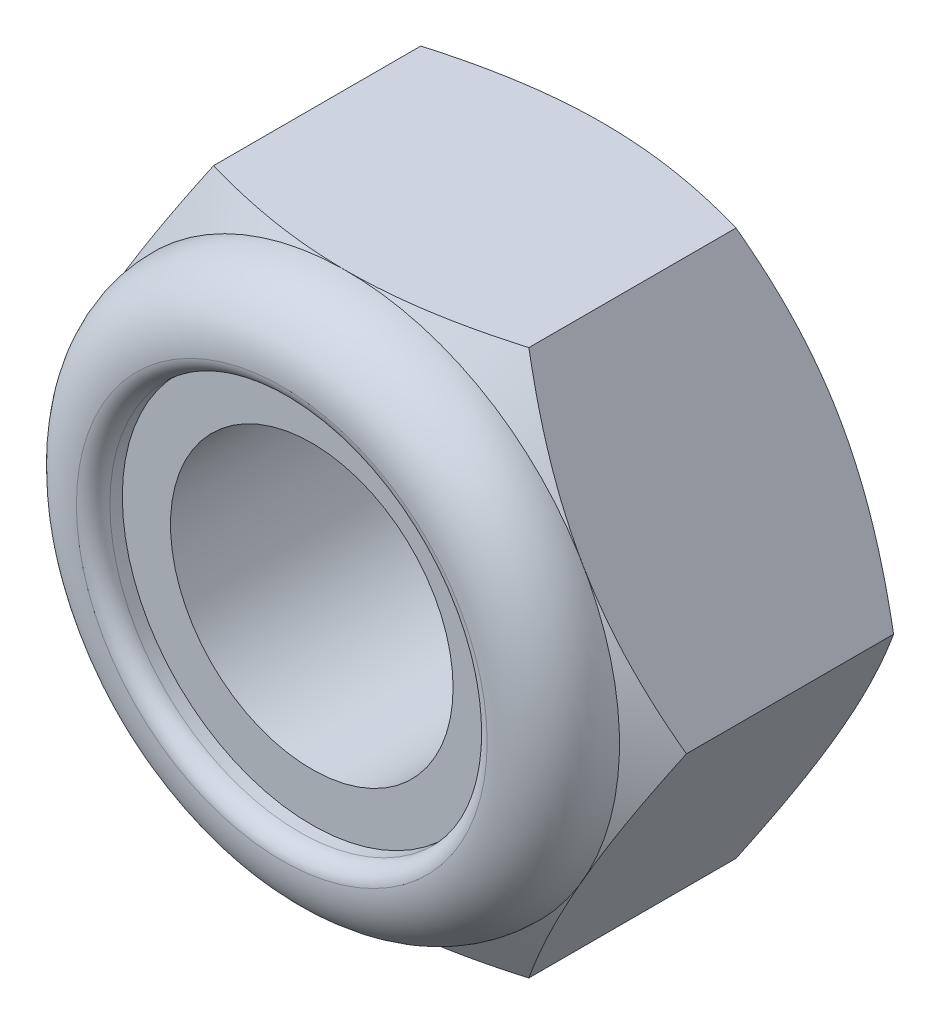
ISO-10303-21;
HEADER;
FILE_DESCRIPTION(('STEP AP214'),'2;1');
FILE_NAME('part.step','',(''),(''),'','','');
FILE_SCHEMA(('AUTOMOTIVE_DESIGN { 1 0 10303 214 1 1 1 1 }'));
ENDSEC;
DATA;
#1=APPLICATION_CONTEXT('core data for automotive mechanical design processes');
#2=APPLICATION_PROTOCOL_DEFINITION('international standard','automotive_design',2000,#1);
#3=PRODUCT_CONTEXT('',#1,'mechanical');
#4=PRODUCT('Part','Part','',(#3));
#5=PRODUCT_RELATED_PRODUCT_CATEGORY('part','',(#4));
#6=PRODUCT_DEFINITION_FORMATION('','',#4);
#7=PRODUCT_DEFINITION_CONTEXT('part definition',#1,'design');
#8=PRODUCT_DEFINITION('design','',#6,#7);
#9=PRODUCT_DEFINITION_SHAPE('','',#8);
#10=(LENGTH_UNIT() NAMED_UNIT(*) SI_UNIT(.MILLI.,.METRE.));
#11=(NAMED_UNIT(*) PLANE_ANGLE_UNIT() SI_UNIT($,.RADIAN.));
#12=(NAMED_UNIT(*) SI_UNIT($,.STERADIAN.) SOLID_ANGLE_UNIT());
#13=UNCERTAINTY_MEASURE_WITH_UNIT(LENGTH_MEASURE(1.E-05),#10,'distance_accuracy_value','');
#14=(GEOMETRIC_REPRESENTATION_CONTEXT(3) GLOBAL_UNCERTAINTY_ASSIGNED_CONTEXT((#13)) GLOBAL_UNIT_ASSIGNED_CONTEXT((#10,
#11,#12)) REPRESENTATION_CONTEXT('',''));
#15=CARTESIAN_POINT('',(0.,0.,0.));
#16=DIRECTION('',(0.,0.,1.));
#17=DIRECTION('',(1.,0.,0.));
#18=AXIS2_PLACEMENT_3D('',#15,#16,#17);
#19=CARTESIAN_POINT('',(-9.81495457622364,0.,10.));
#20=DIRECTION('',(-0.866025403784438,0.5,0.));
#21=DIRECTION('',(-0.5,-0.866025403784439,0.));
#22=AXIS2_PLACEMENT_3D('',#19,#20,#21);
#23=PLANE('',#22);
#24=DIRECTION('',(0.,0.,-1.));
#25=VECTOR('',#24,1.);
#26=CARTESIAN_POINT('',(-9.81495457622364,0.,10.));
#27=LINE('',#26,#25);
#28=CARTESIAN_POINT('',(-9.81495457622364,0.,7.21200305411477));
#29=VERTEX_POINT('',#28);
#30=CARTESIAN_POINT('',(-9.81495457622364,0.,0.761613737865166));
#31=VERTEX_POINT('',#30);
#32=EDGE_CURVE('E234',#29,#31,#27,.T.);
#33=ORIENTED_EDGE('',*,*,#32,.F.);
#34=CARTESIAN_POINT('',(-9.81507004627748,-0.000199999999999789,7.21193542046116));
#35=CARTESIAN_POINT('',(-9.70705850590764,0.186881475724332,7.27518899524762));
#36=CARTESIAN_POINT('',(-9.59863298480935,0.374679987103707,7.33557501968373));
#37=CARTESIAN_POINT('',(-9.38087548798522,0.751847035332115,7.44981541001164));
#38=CARTESIAN_POINT('',(-9.27154312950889,0.941216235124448,7.50366685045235));
#39=CARTESIAN_POINT('',(-8.94174059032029,1.51245098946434,7.65435789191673));
#40=CARTESIAN_POINT('',(-8.71992978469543,1.89663857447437,7.74005467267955));
#41=CARTESIAN_POINT('',(-8.38801743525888,2.47152762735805,7.84043323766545));
#42=CARTESIAN_POINT('',(-8.27893737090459,2.66045984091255,7.86899959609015));
#43=CARTESIAN_POINT('',(-8.06027037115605,3.03920219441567,7.91686032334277));
#44=CARTESIAN_POINT('',(-7.95068348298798,3.22901225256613,7.93615553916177));
#45=CARTESIAN_POINT('',(-7.73131816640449,3.60896412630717,7.96497849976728));
#46=CARTESIAN_POINT('',(-7.62154011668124,3.79910528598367,7.97451774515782));
#47=CARTESIAN_POINT('',(-7.40188222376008,4.17956391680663,7.98362298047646));
#48=CARTESIAN_POINT('',(-7.2920023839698,4.36988138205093,7.98318929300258));
#49=CARTESIAN_POINT('',(-7.08692011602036,4.72509428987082,7.97307899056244));
#50=CARTESIAN_POINT('',(-6.99170201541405,4.89001687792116,7.96463468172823));
#51=CARTESIAN_POINT('',(-6.80149677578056,5.21946201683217,7.9404236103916));
#52=CARTESIAN_POINT('',(-6.70650965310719,5.38398453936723,7.92465634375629));
#53=CARTESIAN_POINT('',(-6.42192724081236,5.87689573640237,7.86674376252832));
#54=CARTESIAN_POINT('',(-6.23285153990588,6.20438445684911,7.81399529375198));
#55=CARTESIAN_POINT('',(-5.85264148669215,6.86292758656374,7.6822474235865));
#56=CARTESIAN_POINT('',(-5.66155830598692,7.19389336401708,7.60267757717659));
#57=CARTESIAN_POINT('',(-5.28231661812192,7.85075923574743,7.42220001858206));
#58=CARTESIAN_POINT('',(-5.09415297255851,8.17666823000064,7.32133583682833));
#59=CARTESIAN_POINT('',(-4.90736181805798,8.5002,7.21193542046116));
#60=B_SPLINE_CURVE_WITH_KNOTS('',3,(#34,#35,#36,#37,#38,#39,#40,#41,#42,#43,#44,#45,#46,#47,#48,
#49,#50,#51,#52,#53,#54,#55,#56,#57,#58,#59),.UNSPECIFIED.,.F.,.F.,(4,2,2,2,2,2,2,2,2,2,2,2,4),
(0.,0.67522427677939,1.35074973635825,2.70470822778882,3.36461689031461,4.02446525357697,
4.68353486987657,5.3425831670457,5.91430726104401,6.48607071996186,7.63043956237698,
8.80086855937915,9.9689277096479),.UNSPECIFIED.);
#61=CARTESIAN_POINT('',(-4.90747728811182,8.5,7.21200305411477));
#62=VERTEX_POINT('',#61);
#63=EDGE_CURVE('E37',#29,#62,#60,.T.);
#64=ORIENTED_EDGE('',*,*,#63,.T.);
#65=DIRECTION('',(0.,0.,-1.));
#66=VECTOR('',#65,1.);
#67=CARTESIAN_POINT('',(-4.90747728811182,8.5,10.));
#68=LINE('',#67,#66);
#69=CARTESIAN_POINT('',(-4.90747728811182,8.5,0.761613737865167));
#70=VERTEX_POINT('',#69);
#71=EDGE_CURVE('E222',#62,#70,#68,.T.);
#72=ORIENTED_EDGE('',*,*,#71,.T.);
#73=CARTESIAN_POINT('',(-9.81507004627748,-0.000199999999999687,0.761680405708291));
#74=CARTESIAN_POINT('',(-9.70719836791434,0.186639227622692,0.699410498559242));
#75=CARTESIAN_POINT('',(-9.59892450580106,0.374175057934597,0.639966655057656));
#76=CARTESIAN_POINT('',(-9.3814974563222,0.750769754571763,0.527509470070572));
#77=CARTESIAN_POINT('',(-9.27234391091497,0.939829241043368,0.474498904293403));
#78=CARTESIAN_POINT('',(-8.94313560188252,1.5100347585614,0.326157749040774));
#79=CARTESIAN_POINT('',(-8.72178130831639,1.89343164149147,0.241783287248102));
#80=CARTESIAN_POINT('',(-8.39052888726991,2.46717766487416,0.14284437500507));
#81=CARTESIAN_POINT('',(-8.28162036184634,2.65581276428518,0.114659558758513));
#82=CARTESIAN_POINT('',(-8.06331079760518,3.03393602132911,0.067398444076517));
#83=CARTESIAN_POINT('',(-7.95390980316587,3.22342410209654,0.0483213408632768));
#84=CARTESIAN_POINT('',(-7.73491944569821,3.6027265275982,0.0197591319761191));
#85=CARTESIAN_POINT('',(-7.62533043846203,3.79254025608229,0.0102631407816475));
#86=CARTESIAN_POINT('',(-7.40605119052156,4.17234305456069,0.0010667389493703));
#87=CARTESIAN_POINT('',(-7.29636095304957,4.36233211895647,0.00136602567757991));
#88=CARTESIAN_POINT('',(-7.09129139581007,4.71752301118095,0.0110788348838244));
#89=CARTESIAN_POINT('',(-6.99589760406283,4.8827499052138,0.0193075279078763));
#90=CARTESIAN_POINT('',(-6.80533344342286,5.21281671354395,0.043013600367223));
#91=CARTESIAN_POINT('',(-6.71016309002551,5.37765660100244,0.05849146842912));
#92=CARTESIAN_POINT('',(-6.42502047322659,5.87153810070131,0.115432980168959));
#93=CARTESIAN_POINT('',(-6.23555293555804,6.19970550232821,0.167397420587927));
#94=CARTESIAN_POINT('',(-5.8546080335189,6.85952142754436,0.297309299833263));
#95=CARTESIAN_POINT('',(-5.66317928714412,7.19108574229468,0.375807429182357));
#96=CARTESIAN_POINT('',(-5.28317649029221,7.84926989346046,0.553965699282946));
#97=CARTESIAN_POINT('',(-5.09459757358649,8.17589815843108,0.653583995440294));
#98=CARTESIAN_POINT('',(-4.90736181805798,8.5002,0.76168040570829));
#99=B_SPLINE_CURVE_WITH_KNOTS('',3,(#73,#74,#75,#76,#77,#78,#79,#80,#81,#82,#83,#84,#85,#86,#87,
#88,#89,#90,#91,#92,#93,#94,#95,#96,#97,#98),.UNSPECIFIED.,.F.,.F.,(4,2,2,2,2,2,2,2,2,2,2,2,4),
(0.,0.673596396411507,1.34748239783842,2.69805431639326,3.356799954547,4.01548737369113,
4.67342558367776,5.33134346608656,5.9040955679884,6.47688628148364,7.62328361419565,
8.79510569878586,9.9646274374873),.UNSPECIFIED.);
#100=EDGE_CURVE('E181',#31,#70,#99,.T.);
#101=ORIENTED_EDGE('',*,*,#100,.F.);
#102=EDGE_LOOP('',(#33,#64,#72,#101));
#103=FACE_BOUND('',#102,.T.);
#104=ADVANCED_FACE('F17',(#103),#23,.T.);
#105=CARTESIAN_POINT('',(-4.90747728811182,8.5,10.));
#106=DIRECTION('',(0.,1.,0.));
#107=DIRECTION('',(0.,0.,1.));
#108=AXIS2_PLACEMENT_3D('',#105,#106,#107);
#109=PLANE('',#108);
#110=ORIENTED_EDGE('',*,*,#71,.F.);
#111=CARTESIAN_POINT('',(-13.052420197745,8.5,3.83760317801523));
#112=CARTESIAN_POINT('',(-12.6827412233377,8.5,4.01899622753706));
#113=CARTESIAN_POINT('',(-12.3121806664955,8.5,4.19862408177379));
#114=CARTESIAN_POINT('',(-11.5688261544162,8.5,4.55335268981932));
#115=CARTESIAN_POINT('',(-11.1960318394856,8.5,4.72845268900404));
#116=CARTESIAN_POINT('',(-10.4457036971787,8.5,5.0740621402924));
#117=CARTESIAN_POINT('',(-10.068154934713,8.5,5.24453928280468));
#118=CARTESIAN_POINT('',(-9.30993829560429,8.5,5.57838295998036));
#119=CARTESIAN_POINT('',(-8.92927057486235,8.5,5.7417498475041));
#120=CARTESIAN_POINT('',(-8.15204195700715,8.5,6.06453215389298));
#121=CARTESIAN_POINT('',(-7.75536000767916,8.5,6.22365774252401));
#122=CARTESIAN_POINT('',(-6.9571875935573,8.5,6.52959399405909));
#123=CARTESIAN_POINT('',(-6.5556965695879,8.5,6.67640320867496));
#124=CARTESIAN_POINT('',(-5.7480525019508,8.5,6.95373914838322));
#125=CARTESIAN_POINT('',(-5.34191160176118,8.5,7.08430084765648));
#126=CARTESIAN_POINT('',(-4.52365699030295,8.5,7.3248539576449));
#127=CARTESIAN_POINT('',(-4.11154531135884,8.5,7.43485219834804));
#128=CARTESIAN_POINT('',(-3.28331959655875,8.5,7.62828088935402));
#129=CARTESIAN_POINT('',(-2.86723939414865,8.5,7.71185220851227));
#130=CARTESIAN_POINT('',(-2.23932711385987,8.5,7.81366833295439));
#131=CARTESIAN_POINT('',(-2.02937499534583,8.5,7.8436849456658));
#132=CARTESIAN_POINT('',(-1.60844270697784,8.5,7.89527245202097));
#133=CARTESIAN_POINT('',(-1.39746264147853,8.5,7.9168441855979));
#134=CARTESIAN_POINT('',(-0.977537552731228,8.5,7.95083652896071));
#135=CARTESIAN_POINT('',(-0.768601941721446,8.5,7.96337298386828));
#136=CARTESIAN_POINT('',(-0.350385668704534,8.5,7.979461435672));
#137=CARTESIAN_POINT('',(-0.141105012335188,8.5,7.98301357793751));
#138=CARTESIAN_POINT('',(0.277417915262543,8.5,7.98104779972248));
#139=CARTESIAN_POINT('',(0.486660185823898,8.5,7.97552973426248));
#140=CARTESIAN_POINT('',(0.904720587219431,8.5,7.95555716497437));
#141=CARTESIAN_POINT('',(1.11353869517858,8.5,7.94110219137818));
#142=CARTESIAN_POINT('',(1.61395168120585,8.5,7.89605430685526));
#143=CARTESIAN_POINT('',(1.90518018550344,8.5,7.8613154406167));
#144=CARTESIAN_POINT('',(2.48535369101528,8.5,7.77634714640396));
#145=CARTESIAN_POINT('',(2.77429837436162,8.5,7.7261155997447));
#146=CARTESIAN_POINT('',(3.63741866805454,8.5,7.55478978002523));
#147=CARTESIAN_POINT('',(4.20755559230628,8.5,7.41309721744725));
#148=CARTESIAN_POINT('',(5.05986022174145,8.5,7.16873237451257));
#149=CARTESIAN_POINT('',(5.34652278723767,8.5,7.08085728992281));
#150=CARTESIAN_POINT('',(5.91702450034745,8.5,6.89629543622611));
#151=CARTESIAN_POINT('',(6.20086362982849,8.5,6.7996086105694));
#152=CARTESIAN_POINT('',(6.76581362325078,8.5,6.59892899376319));
#153=CARTESIAN_POINT('',(7.04692539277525,8.5,6.49493872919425));
#154=CARTESIAN_POINT('',(7.60679745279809,8.5,6.2808342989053));
#155=CARTESIAN_POINT('',(7.8855577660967,8.5,6.1707201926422));
#156=CARTESIAN_POINT('',(8.52530505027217,8.5,5.91117144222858));
#157=CARTESIAN_POINT('',(8.8855647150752,8.5,5.75994772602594));
#158=CARTESIAN_POINT('',(9.60310529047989,8.5,5.45057298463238));
#159=CARTESIAN_POINT('',(9.96038604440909,8.5,5.29242159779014));
#160=CARTESIAN_POINT('',(10.6724943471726,8.5,4.97051845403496));
#161=CARTESIAN_POINT('',(11.0273213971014,8.5,4.80676559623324));
#162=CARTESIAN_POINT('',(11.7348421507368,8.5,4.4747396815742));
#163=CARTESIAN_POINT('',(12.0875358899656,8.5,4.30646670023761));
#164=CARTESIAN_POINT('',(12.7914579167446,8.5,3.96605324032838));
#165=CARTESIAN_POINT('',(13.1426845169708,8.5,3.79390927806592));
#166=CARTESIAN_POINT('',(13.8436123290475,8.5,3.44654077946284));
#167=CARTESIAN_POINT('',(14.1933135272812,8.5,3.27131621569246));
#168=CARTESIAN_POINT('',(15.2404946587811,8.5,2.74180239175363));
#169=CARTESIAN_POINT('',(15.9360373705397,8.5,2.38368019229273));
#170=CARTESIAN_POINT('',(16.9487642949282,8.5,1.85549222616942));
#171=CARTESIAN_POINT('',(17.2674552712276,8.5,1.6882972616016));
#172=CARTESIAN_POINT('',(17.9041190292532,8.5,1.35255777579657));
#173=CARTESIAN_POINT('',(18.2220918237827,8.5,1.18401327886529));
#174=CARTESIAN_POINT('',(19.1750995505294,8.5,0.67661130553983));
#175=CARTESIAN_POINT('',(19.8091995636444,8.5,0.335998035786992));
#176=CARTESIAN_POINT('',(21.0739720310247,8.5,-0.34801940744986));
#177=CARTESIAN_POINT('',(21.7046490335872,8.5,-0.691415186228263));
#178=CARTESIAN_POINT('',(22.9644072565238,8.5,-1.38104539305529));
#179=CARTESIAN_POINT('',(23.5934885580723,8.5,-1.7272796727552));
#180=CARTESIAN_POINT('',(24.2219753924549,8.5,-2.07458278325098));
#181=B_SPLINE_CURVE_WITH_KNOTS('',3,(#111,#112,#113,#114,#115,#116,#117,#118,#119,#120,#121,
#122,#123,#124,#125,#126,#127,#128,#129,#130,#131,#132,#133,#134,#135,#136,#137,#138,#139,#140,
#141,#142,#143,#144,#145,#146,#147,#148,#149,#150,#151,#152,#153,#154,#155,#156,#157,#158,#159,
#160,#161,#162,#163,#164,#165,#166,#167,#168,#169,#170,#171,#172,#173,#174,#175,#176,#177,#178,
#179,#180),.UNSPECIFIED.,.F.,.F.,(4,2,2,2,2,2,2,2,2,2,2,2,2,2,2,2,2,2,2,2,2,2,2,2,2,2,2,2,2,2,2,
2,2,2,4),(0.,1.23536768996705,2.47093995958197,3.71364008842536,4.95627847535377,
6.2383434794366,7.52055903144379,8.7999649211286,10.0789451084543,11.3509880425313,
11.9871057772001,12.6231602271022,13.2509070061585,13.878643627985,14.506390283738,
15.1341699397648,16.0135535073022,16.8930573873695,18.6530405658,19.5524547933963,
20.4518747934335,21.3509851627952,22.2500868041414,23.4221263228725,24.5942270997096,
25.7665595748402,26.9388724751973,28.112286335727,29.2857106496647,31.6326085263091,
32.7122660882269,33.7919042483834,35.9512627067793,38.1055687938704,40.2597629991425),.UNSPECIFIED.);
#182=CARTESIAN_POINT('',(4.90747728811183,8.5,7.21200305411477));
#183=VERTEX_POINT('',#182);
#184=EDGE_CURVE('E194',#62,#183,#181,.T.);
#185=ORIENTED_EDGE('',*,*,#184,.T.);
#186=DIRECTION('',(0.,0.,-1.));
#187=VECTOR('',#186,1.);
#188=CARTESIAN_POINT('',(4.90747728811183,8.5,10.));
#189=LINE('',#188,#187);
#190=CARTESIAN_POINT('',(4.90747728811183,8.5,0.761613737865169));
#191=VERTEX_POINT('',#190);
#192=EDGE_CURVE('E224',#183,#191,#189,.T.);
#193=ORIENTED_EDGE('',*,*,#192,.T.);
#194=CARTESIAN_POINT('',(-13.1446292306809,8.5,4.13248503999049));
#195=CARTESIAN_POINT('',(-12.7736971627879,8.5,3.95270066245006));
#196=CARTESIAN_POINT('',(-12.4019095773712,8.5,3.77465097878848));
#197=CARTESIAN_POINT('',(-11.6561682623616,8.5,3.42299736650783));
#198=CARTESIAN_POINT('',(-11.2822141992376,8.5,3.24939414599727));
#199=CARTESIAN_POINT('',(-10.5297400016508,8.5,2.90672837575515));
#200=CARTESIAN_POINT('',(-10.1512060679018,8.5,2.73769602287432));
#201=CARTESIAN_POINT('',(-9.39111446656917,8.5,2.40659871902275));
#202=CARTESIAN_POINT('',(-9.00955694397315,8.5,2.24453343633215));
#203=CARTESIAN_POINT('',(-8.23062704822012,8.5,1.924200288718));
#204=CARTESIAN_POINT('',(-7.833137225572,8.5,1.7662164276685));
#205=CARTESIAN_POINT('',(-7.03349432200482,8.5,1.46229642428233));
#206=CARTESIAN_POINT('',(-6.6313407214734,8.5,1.31636163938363));
#207=CARTESIAN_POINT('',(-5.82249055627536,8.5,1.04039888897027));
#208=CARTESIAN_POINT('',(-5.4158052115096,8.5,0.910338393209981));
#209=CARTESIAN_POINT('',(-4.59661572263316,8.5,0.670320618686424));
#210=CARTESIAN_POINT('',(-4.18411346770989,8.5,0.560356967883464));
#211=CARTESIAN_POINT('',(-3.35527671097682,8.5,0.366426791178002));
#212=CARTESIAN_POINT('',(-2.93897587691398,8.5,0.282320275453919));
#213=CARTESIAN_POINT('',(-2.31076372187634,8.5,0.179211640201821));
#214=CARTESIAN_POINT('',(-2.1007171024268,8.5,0.148682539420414));
#215=CARTESIAN_POINT('',(-1.67959261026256,8.5,0.0959077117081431));
#216=CARTESIAN_POINT('',(-1.46851483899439,8.5,0.0736611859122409));
#217=CARTESIAN_POINT('',(-1.04835140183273,8.5,0.0381717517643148));
#218=CARTESIAN_POINT('',(-0.839275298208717,8.5,0.0248160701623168));
#219=CARTESIAN_POINT('',(-0.42074584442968,8.5,0.00695548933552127));
#220=CARTESIAN_POINT('',(-0.211292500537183,8.5,0.00245044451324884));
#221=CARTESIAN_POINT('',(0.207617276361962,8.5,0.00239850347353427));
#222=CARTESIAN_POINT('',(0.41707370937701,8.5,0.00685163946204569));
#223=CARTESIAN_POINT('',(0.835613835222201,8.5,0.0246078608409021));
#224=CARTESIAN_POINT('',(1.04469750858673,8.5,0.0379113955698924));
#225=CARTESIAN_POINT('',(1.54834290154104,8.5,0.0803367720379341));
#226=CARTESIAN_POINT('',(1.84255295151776,8.5,0.113721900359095));
#227=CARTESIAN_POINT('',(2.42875078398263,8.5,0.196186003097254));
#228=CARTESIAN_POINT('',(2.72073825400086,8.5,0.245267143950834));
#229=CARTESIAN_POINT('',(3.59305561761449,8.5,0.413448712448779));
#230=CARTESIAN_POINT('',(4.16940598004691,8.5,0.553455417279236));
#231=CARTESIAN_POINT('',(5.03112734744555,8.5,0.795748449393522));
#232=CARTESIAN_POINT('',(5.32098083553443,8.5,0.883005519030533));
#233=CARTESIAN_POINT('',(5.89787185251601,8.5,1.06646139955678));
#234=CARTESIAN_POINT('',(6.18490936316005,8.5,1.16266026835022));
#235=CARTESIAN_POINT('',(6.75626079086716,8.5,1.36246640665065));
#236=CARTESIAN_POINT('',(7.04057559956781,8.5,1.46607114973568));
#237=CARTESIAN_POINT('',(7.60685807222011,8.5,1.67948215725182));
#238=CARTESIAN_POINT('',(7.88882576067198,8.5,1.78928835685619));
#239=CARTESIAN_POINT('',(8.54169401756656,8.5,2.05048527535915));
#240=CARTESIAN_POINT('',(8.91181373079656,8.5,2.20382385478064));
#241=CARTESIAN_POINT('',(9.64900147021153,8.5,2.51768938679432));
#242=CARTESIAN_POINT('',(10.0160693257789,8.5,2.67821673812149));
#243=CARTESIAN_POINT('',(10.7477045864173,8.5,3.00505563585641));
#244=CARTESIAN_POINT('',(11.1122714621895,8.5,3.17136836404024));
#245=CARTESIAN_POINT('',(11.8392356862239,8.5,3.50864080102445));
#246=CARTESIAN_POINT('',(12.2016330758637,8.5,3.67960042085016));
#247=CARTESIAN_POINT('',(12.9249805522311,8.5,4.02549390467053));
#248=CARTESIAN_POINT('',(13.2859287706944,8.5,4.20043166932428));
#249=CARTESIAN_POINT('',(14.0062860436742,8.5,4.55345081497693));
#250=CARTESIAN_POINT('',(14.3656950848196,8.5,4.73153222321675));
#251=CARTESIAN_POINT('',(15.4418842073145,8.5,5.2696299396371));
#252=CARTESIAN_POINT('',(16.1567158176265,8.5,5.63354289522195));
#253=CARTESIAN_POINT('',(17.5248054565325,8.5,6.33894450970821));
#254=CARTESIAN_POINT('',(18.1783597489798,8.5,6.67986110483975));
#255=CARTESIAN_POINT('',(19.4830156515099,8.5,7.36640323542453));
#256=CARTESIAN_POINT('',(20.1341171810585,8.5,7.71202892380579));
#257=CARTESIAN_POINT('',(21.4328566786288,8.5,8.40605654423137));
#258=CARTESIAN_POINT('',(22.08049919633,8.5,8.75444997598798));
#259=CARTESIAN_POINT('',(23.3742081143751,8.5,9.45407140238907));
#260=CARTESIAN_POINT('',(24.0202745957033,8.5,9.8052992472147));
#261=CARTESIAN_POINT('',(24.6657573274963,8.5,10.1575894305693));
#262=B_SPLINE_CURVE_WITH_KNOTS('',3,(#194,#195,#196,#197,#198,#199,#200,#201,#202,#203,#204,
#205,#206,#207,#208,#209,#210,#211,#212,#213,#214,#215,#216,#217,#218,#219,#220,#221,#222,#223,
#224,#225,#226,#227,#228,#229,#230,#231,#232,#233,#234,#235,#236,#237,#238,#239,#240,#241,#242,
#243,#244,#245,#246,#247,#248,#249,#250,#251,#252,#253,#254,#255,#256,#257,#258,#259,#260,#261),
.UNSPECIFIED.,.F.,.F.,(4,2,2,2,2,2,2,2,2,2,2,2,2,2,2,2,2,2,2,2,2,2,2,2,2,2,2,2,2,2,2,2,2,4),(0.,
1.23663049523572,2.47345671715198,3.71708004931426,4.96064410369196,6.24369695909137,
7.52689416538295,8.80741599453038,10.0875311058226,11.3605884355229,11.9972117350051,
12.633773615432,13.2620990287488,13.8904141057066,14.5187314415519,15.14708067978,
16.0348726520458,16.9227872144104,18.6996198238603,19.6076533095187,20.5156926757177,
21.4234237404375,22.3311453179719,23.5329228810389,24.7347671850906,25.9368584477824,
27.1389267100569,28.342229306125,29.5455423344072,31.9518702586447,34.1632330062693,
36.3746677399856,38.5808717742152,40.7869599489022),.UNSPECIFIED.);
#263=EDGE_CURVE('E176',#70,#191,#262,.T.);
#264=ORIENTED_EDGE('',*,*,#263,.F.);
#265=EDGE_LOOP('',(#110,#185,#193,#264));
#266=FACE_BOUND('',#265,.T.);
#267=ADVANCED_FACE('F186',(#266),#109,.T.);
#268=CARTESIAN_POINT('',(4.90747728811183,8.5,10.));
#269=DIRECTION('',(0.866025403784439,0.499999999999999,0.));
#270=DIRECTION('',(-0.499999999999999,0.866025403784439,0.));
#271=AXIS2_PLACEMENT_3D('',#268,#269,#270);
#272=PLANE('',#271);
#273=ORIENTED_EDGE('',*,*,#192,.F.);
#274=CARTESIAN_POINT('',(4.90736181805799,8.5002,7.21193542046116));
#275=CARTESIAN_POINT('',(5.01537335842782,8.31311852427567,7.27518899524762));
#276=CARTESIAN_POINT('',(5.12379887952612,8.12532001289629,7.33557501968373));
#277=CARTESIAN_POINT('',(5.34155637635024,7.74815296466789,7.44981541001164));
#278=CARTESIAN_POINT('',(5.45088873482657,7.55878376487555,7.50366685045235));
#279=CARTESIAN_POINT('',(5.78069127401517,6.98754901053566,7.65435789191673));
#280=CARTESIAN_POINT('',(6.00250207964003,6.60336142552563,7.74005467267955));
#281=CARTESIAN_POINT('',(6.33441442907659,6.02847237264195,7.84043323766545));
#282=CARTESIAN_POINT('',(6.44349449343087,5.83954015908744,7.86899959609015));
#283=CARTESIAN_POINT('',(6.66216149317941,5.46079780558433,7.91686032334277));
#284=CARTESIAN_POINT('',(6.77174838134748,5.27098774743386,7.93615553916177));
#285=CARTESIAN_POINT('',(6.99111369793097,4.89103587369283,7.96497849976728));
#286=CARTESIAN_POINT('',(7.10089174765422,4.70089471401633,7.97451774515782));
#287=CARTESIAN_POINT('',(7.32054964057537,4.32043608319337,7.98362298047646));
#288=CARTESIAN_POINT('',(7.43042948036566,4.13011861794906,7.98318929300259));
#289=CARTESIAN_POINT('',(7.6355117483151,3.77490571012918,7.97307899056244));
#290=CARTESIAN_POINT('',(7.73072984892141,3.60998312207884,7.96463468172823));
#291=CARTESIAN_POINT('',(7.9209350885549,3.28053798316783,7.9404236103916));
#292=CARTESIAN_POINT('',(8.01592221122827,3.11601546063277,7.92465634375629));
#293=CARTESIAN_POINT('',(8.30050462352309,2.62310426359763,7.86674376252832));
#294=CARTESIAN_POINT('',(8.48958032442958,2.29561554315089,7.81399529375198));
#295=CARTESIAN_POINT('',(8.8697903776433,1.63707241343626,7.6822474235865));
#296=CARTESIAN_POINT('',(9.06087355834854,1.30610663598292,7.60267757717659));
#297=CARTESIAN_POINT('',(9.44011524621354,0.649240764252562,7.42220001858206));
#298=CARTESIAN_POINT('',(9.62827889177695,0.323331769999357,7.32133583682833));
#299=CARTESIAN_POINT('',(9.81507004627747,-0.000200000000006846,7.21193542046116));
#300=B_SPLINE_CURVE_WITH_KNOTS('',3,(#274,#275,#276,#277,#278,#279,#280,#281,#282,#283,#284,
#285,#286,#287,#288,#289,#290,#291,#292,#293,#294,#295,#296,#297,#298,#299),.UNSPECIFIED.,.F.,
.F.,(4,2,2,2,2,2,2,2,2,2,2,2,4),(0.,0.675224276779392,1.35074973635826,2.70470822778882,
3.36461689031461,4.02446525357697,4.68353486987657,5.3425831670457,5.91430726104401,
6.48607071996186,7.63043956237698,8.80086855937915,9.9689277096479),.UNSPECIFIED.);
#301=CARTESIAN_POINT('',(9.81495457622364,0.,7.21200305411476));
#302=VERTEX_POINT('',#301);
#303=EDGE_CURVE('E199',#183,#302,#300,.T.);
#304=ORIENTED_EDGE('',*,*,#303,.T.);
#305=DIRECTION('',(0.,0.,-1.));
#306=VECTOR('',#305,1.);
#307=CARTESIAN_POINT('',(9.81495457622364,0.,10.));
#308=LINE('',#307,#306);
#309=CARTESIAN_POINT('',(9.81495457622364,0.,0.761613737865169));
#310=VERTEX_POINT('',#309);
#311=EDGE_CURVE('E227',#302,#310,#308,.T.);
#312=ORIENTED_EDGE('',*,*,#311,.T.);
#313=CARTESIAN_POINT('',(4.90736181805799,8.5002,0.761680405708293));
#314=CARTESIAN_POINT('',(5.01523349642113,8.31336077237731,0.699410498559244));
#315=CARTESIAN_POINT('',(5.12350735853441,8.1258249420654,0.639966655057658));
#316=CARTESIAN_POINT('',(5.34093440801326,7.74923024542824,0.527509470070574));
#317=CARTESIAN_POINT('',(5.45008795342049,7.56017075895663,0.474498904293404));
#318=CARTESIAN_POINT('',(5.77929626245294,6.9899652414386,0.326157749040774));
#319=CARTESIAN_POINT('',(6.00065055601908,6.60656835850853,0.241783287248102));
#320=CARTESIAN_POINT('',(6.33190297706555,6.03282233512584,0.14284437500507));
#321=CARTESIAN_POINT('',(6.44081150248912,5.84418723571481,0.114659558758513));
#322=CARTESIAN_POINT('',(6.65912106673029,5.46606397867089,0.0673984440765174));
#323=CARTESIAN_POINT('',(6.76852206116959,5.27657589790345,0.0483213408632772));
#324=CARTESIAN_POINT('',(6.98751241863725,4.89727347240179,0.0197591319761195));
#325=CARTESIAN_POINT('',(7.09710142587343,4.7074597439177,0.0102631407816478));
#326=CARTESIAN_POINT('',(7.3163806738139,4.32765694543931,0.00106673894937));
#327=CARTESIAN_POINT('',(7.42607091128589,4.13766788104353,0.00136602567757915));
#328=CARTESIAN_POINT('',(7.63114046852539,3.78247698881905,0.0110788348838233));
#329=CARTESIAN_POINT('',(7.72653426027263,3.61725009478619,0.0193075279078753));
#330=CARTESIAN_POINT('',(7.9170984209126,3.28718328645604,0.0430136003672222));
#331=CARTESIAN_POINT('',(8.01226877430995,3.12234339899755,0.0584914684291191));
#332=CARTESIAN_POINT('',(8.29741139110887,2.62846189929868,0.115432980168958));
#333=CARTESIAN_POINT('',(8.48687892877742,2.30029449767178,0.167397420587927));
#334=CARTESIAN_POINT('',(8.86782383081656,1.64047857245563,0.297309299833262));
#335=CARTESIAN_POINT('',(9.05925257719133,1.30891425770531,0.375807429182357));
#336=CARTESIAN_POINT('',(9.43925537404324,0.650730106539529,0.553965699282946));
#337=CARTESIAN_POINT('',(9.62783429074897,0.324101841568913,0.653583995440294));
#338=CARTESIAN_POINT('',(9.81507004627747,-0.00020000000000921,0.761680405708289));
#339=B_SPLINE_CURVE_WITH_KNOTS('',3,(#313,#314,#315,#316,#317,#318,#319,#320,#321,#322,#323,
#324,#325,#326,#327,#328,#329,#330,#331,#332,#333,#334,#335,#336,#337,#338),.UNSPECIFIED.,.F.,
.F.,(4,2,2,2,2,2,2,2,2,2,2,2,4),(0.,0.673596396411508,1.34748239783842,2.69805431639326,
3.356799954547,4.01548737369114,4.67342558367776,5.33134346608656,5.9040955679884,
6.47688628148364,7.62328361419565,8.79510569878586,9.96462743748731),.UNSPECIFIED.);
#340=EDGE_CURVE('E171',#191,#310,#339,.T.);
#341=ORIENTED_EDGE('',*,*,#340,.F.);
#342=EDGE_LOOP('',(#273,#304,#312,#341));
#343=FACE_BOUND('',#342,.T.);
#344=ADVANCED_FACE('F189',(#343),#272,.T.);
#345=CARTESIAN_POINT('',(9.81495457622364,0.,10.));
#346=DIRECTION('',(0.866025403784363,-0.500000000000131,0.));
#347=DIRECTION('',(0.500000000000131,0.866025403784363,0.));
#348=AXIS2_PLACEMENT_3D('',#345,#346,#347);
#349=PLANE('',#348);
#350=ORIENTED_EDGE('',*,*,#311,.F.);
#351=CARTESIAN_POINT('',(9.81507004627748,0.000199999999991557,7.21193542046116));
#352=CARTESIAN_POINT('',(9.70705850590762,-0.18688147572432,7.27518899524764));
#353=CARTESIAN_POINT('',(9.5986329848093,-0.374679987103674,7.33557501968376));
#354=CARTESIAN_POINT('',(9.38087548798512,-0.751847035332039,7.4498154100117));
#355=CARTESIAN_POINT('',(9.27154312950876,-0.941216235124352,7.50366685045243));
#356=CARTESIAN_POINT('',(8.94174059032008,-1.51245098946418,7.65435789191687));
#357=CARTESIAN_POINT('',(8.71992978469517,-1.89663857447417,7.74005467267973));
#358=CARTESIAN_POINT('',(8.38801743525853,-2.47152762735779,7.84043323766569));
#359=CARTESIAN_POINT('',(8.27893737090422,-2.66045984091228,7.8689995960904));
#360=CARTESIAN_POINT('',(8.06027037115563,-3.03920219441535,7.91686032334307));
#361=CARTESIAN_POINT('',(7.95068348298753,-3.2290122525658,7.93615553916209));
#362=CARTESIAN_POINT('',(7.73131816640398,-3.6089641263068,7.96497849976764));
#363=CARTESIAN_POINT('',(7.6215401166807,-3.79910528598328,7.9745177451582));
#364=CARTESIAN_POINT('',(7.40188222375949,-4.1795639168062,7.98362298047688));
#365=CARTESIAN_POINT('',(7.29200238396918,-4.36988138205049,7.98318929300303));
#366=CARTESIAN_POINT('',(7.0869201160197,-4.72509428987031,7.97307899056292));
#367=CARTESIAN_POINT('',(6.99170201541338,-4.89001687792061,7.96463468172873));
#368=CARTESIAN_POINT('',(6.80149677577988,-5.21946201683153,7.94042361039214));
#369=CARTESIAN_POINT('',(6.7065096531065,-5.38398453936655,7.92465634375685));
#370=CARTESIAN_POINT('',(6.42192724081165,-5.87689573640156,7.86674376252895));
#371=CARTESIAN_POINT('',(6.23285153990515,-6.20438445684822,7.81399529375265));
#372=CARTESIAN_POINT('',(5.85264148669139,-6.86292758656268,7.68224742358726));
#373=CARTESIAN_POINT('',(5.66155830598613,-7.19389336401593,7.6026775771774));
#374=CARTESIAN_POINT('',(5.2823166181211,-7.85075923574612,7.42220001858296));
#375=CARTESIAN_POINT('',(5.09415297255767,-8.17666822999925,7.32133583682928));
#376=CARTESIAN_POINT('',(4.90736181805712,-8.50019999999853,7.21193542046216));
#377=B_SPLINE_CURVE_WITH_KNOTS('',3,(#351,#352,#353,#354,#355,#356,#357,#358,#359,#360,#361,
#362,#363,#364,#365,#366,#367,#368,#369,#370,#371,#372,#373,#374,#375,#376),.UNSPECIFIED.,.F.,
.F.,(4,2,2,2,2,2,2,2,2,2,2,2,4),(0.,0.675224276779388,1.35074973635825,2.70470822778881,
3.3646168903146,4.02446525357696,4.68353486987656,5.34258316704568,5.91430726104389,
6.48607071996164,7.63043956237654,8.8008685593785,9.96892770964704),.UNSPECIFIED.);
#378=CARTESIAN_POINT('',(4.90747728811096,-8.49999999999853,7.21200305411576));
#379=VERTEX_POINT('',#378);
#380=EDGE_CURVE('E111',#302,#379,#377,.T.);
#381=ORIENTED_EDGE('',*,*,#380,.T.);
#382=DIRECTION('',(0.,0.,-1.));
#383=VECTOR('',#382,1.);
#384=CARTESIAN_POINT('',(4.90747728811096,-8.49999999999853,10.));
#385=LINE('',#384,#383);
#386=CARTESIAN_POINT('',(4.90747728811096,-8.49999999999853,0.761613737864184));
#387=VERTEX_POINT('',#386);
#388=EDGE_CURVE('E229',#379,#387,#385,.T.);
#389=ORIENTED_EDGE('',*,*,#388,.T.);
#390=CARTESIAN_POINT('',(9.81507004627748,0.000199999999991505,0.76168040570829));
#391=CARTESIAN_POINT('',(9.70719836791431,-0.186639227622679,0.699410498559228));
#392=CARTESIAN_POINT('',(9.598924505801,-0.374175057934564,0.639966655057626));
#393=CARTESIAN_POINT('',(9.3814974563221,-0.750769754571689,0.527509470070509));
#394=CARTESIAN_POINT('',(9.27234391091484,-0.939829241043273,0.474498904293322));
#395=CARTESIAN_POINT('',(8.94313560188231,-1.51003475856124,0.326157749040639));
#396=CARTESIAN_POINT('',(8.72178130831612,-1.89343164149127,0.241783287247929));
#397=CARTESIAN_POINT('',(8.39052888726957,-2.4671776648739,0.142844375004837));
#398=CARTESIAN_POINT('',(8.28162036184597,-2.65581276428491,0.11465955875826));
#399=CARTESIAN_POINT('',(8.06331079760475,-3.0339360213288,0.0673984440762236));
#400=CARTESIAN_POINT('',(7.95390980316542,-3.22342410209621,0.048321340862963));
#401=CARTESIAN_POINT('',(7.7349194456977,-3.60272652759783,0.0197591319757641));
#402=CARTESIAN_POINT('',(7.6253304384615,-3.79254025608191,0.0102631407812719));
#403=CARTESIAN_POINT('',(7.40605119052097,-4.17234305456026,0.0010667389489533));
#404=CARTESIAN_POINT('',(7.29636095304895,-4.36233211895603,0.00136602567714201));
#405=CARTESIAN_POINT('',(7.09129139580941,-4.71752301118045,0.0110788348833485));
#406=CARTESIAN_POINT('',(6.99589760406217,-4.88274990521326,0.0193075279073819));
#407=CARTESIAN_POINT('',(6.80533344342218,-5.21281671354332,0.0430136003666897));
#408=CARTESIAN_POINT('',(6.71016309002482,-5.37765660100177,0.0584914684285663));
#409=CARTESIAN_POINT('',(6.42502047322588,-5.87153810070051,0.115432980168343));
#410=CARTESIAN_POINT('',(6.23555293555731,-6.19970550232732,0.167397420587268));
#411=CARTESIAN_POINT('',(5.85460803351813,-6.8595214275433,0.297309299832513));
#412=CARTESIAN_POINT('',(5.66317928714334,-7.19108574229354,0.37580742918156));
#413=CARTESIAN_POINT('',(5.28317649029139,-7.84926989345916,0.553965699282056));
#414=CARTESIAN_POINT('',(5.09459757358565,-8.17589815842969,0.653583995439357));
#415=CARTESIAN_POINT('',(4.90736181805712,-8.50019999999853,0.761680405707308));
#416=B_SPLINE_CURVE_WITH_KNOTS('',3,(#390,#391,#392,#393,#394,#395,#396,#397,#398,#399,#400,
#401,#402,#403,#404,#405,#406,#407,#408,#409,#410,#411,#412,#413,#414,#415),.UNSPECIFIED.,.F.,
.F.,(4,2,2,2,2,2,2,2,2,2,2,2,4),(0.,0.673596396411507,1.34748239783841,2.69805431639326,
3.35679995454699,4.01548737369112,4.67342558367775,5.33134346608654,5.90409556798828,
6.47688628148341,7.62328361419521,8.79510569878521,9.96462743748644),.UNSPECIFIED.);
#417=EDGE_CURVE('E146',#310,#387,#416,.T.);
#418=ORIENTED_EDGE('',*,*,#417,.F.);
#419=EDGE_LOOP('',(#350,#381,#389,#418));
#420=FACE_BOUND('',#419,.T.);
#421=ADVANCED_FACE('F133',(#420),#349,.T.);
#422=CARTESIAN_POINT('',(4.90747728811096,-8.49999999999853,10.));
#423=DIRECTION('',(1.49701231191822E-13,-1.,0.));
#424=DIRECTION('',(1.,1.49701231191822E-13,0.));
#425=AXIS2_PLACEMENT_3D('',#422,#423,#424);
#426=PLANE('',#425);
#427=ORIENTED_EDGE('',*,*,#388,.F.);
#428=CARTESIAN_POINT('',(-13.0524201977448,-8.50000000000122,3.83760317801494));
#429=CARTESIAN_POINT('',(-12.6827412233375,-8.50000000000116,4.01899622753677));
#430=CARTESIAN_POINT('',(-12.3121806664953,-8.50000000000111,4.1986240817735));
#431=CARTESIAN_POINT('',(-11.568826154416,-8.500000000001,4.55335268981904));
#432=CARTESIAN_POINT('',(-11.1960318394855,-8.50000000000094,4.72845268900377));
#433=CARTESIAN_POINT('',(-10.4457036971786,-8.50000000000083,5.07406214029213));
#434=CARTESIAN_POINT('',(-10.0681549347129,-8.50000000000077,5.24453928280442));
#435=CARTESIAN_POINT('',(-9.30993829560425,-8.50000000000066,5.57838295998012));
#436=CARTESIAN_POINT('',(-8.92927057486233,-8.5000000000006,5.74174984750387));
#437=CARTESIAN_POINT('',(-8.15204195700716,-8.50000000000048,6.06453215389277));
#438=CARTESIAN_POINT('',(-7.75536000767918,-8.50000000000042,6.22365774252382));
#439=CARTESIAN_POINT('',(-6.95718759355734,-8.50000000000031,6.52959399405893));
#440=CARTESIAN_POINT('',(-6.55569656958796,-8.50000000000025,6.67640320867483));
#441=CARTESIAN_POINT('',(-5.74805250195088,-8.50000000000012,6.95373914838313));
#442=CARTESIAN_POINT('',(-5.34191160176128,-8.50000000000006,7.08430084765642));
#443=CARTESIAN_POINT('',(-4.52365699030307,-8.49999999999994,7.3248539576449));
#444=CARTESIAN_POINT('',(-4.11154531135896,-8.49999999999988,7.43485219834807));
#445=CARTESIAN_POINT('',(-3.28331959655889,-8.49999999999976,7.62828088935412));
#446=CARTESIAN_POINT('',(-2.86723939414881,-8.49999999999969,7.7118522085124));
#447=CARTESIAN_POINT('',(-2.23932711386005,-8.4999999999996,7.81366833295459));
#448=CARTESIAN_POINT('',(-2.02937499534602,-8.49999999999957,7.84368494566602));
#449=CARTESIAN_POINT('',(-1.60844270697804,-8.4999999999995,7.89527245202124));
#450=CARTESIAN_POINT('',(-1.39746264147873,-8.49999999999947,7.91684418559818));
#451=CARTESIAN_POINT('',(-0.977537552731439,-8.49999999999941,7.95083652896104));
#452=CARTESIAN_POINT('',(-0.768601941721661,-8.49999999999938,7.96337298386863));
#453=CARTESIAN_POINT('',(-0.350385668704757,-8.49999999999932,7.97946143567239));
#454=CARTESIAN_POINT('',(-0.141105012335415,-8.49999999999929,7.98301357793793));
#455=CARTESIAN_POINT('',(0.27741791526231,-8.49999999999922,7.98104779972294));
#456=CARTESIAN_POINT('',(0.486660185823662,-8.49999999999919,7.97552973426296));
#457=CARTESIAN_POINT('',(0.90472058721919,-8.49999999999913,7.95555716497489));
#458=CARTESIAN_POINT('',(1.11353869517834,-8.4999999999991,7.94110219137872));
#459=CARTESIAN_POINT('',(1.61395168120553,-8.49999999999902,7.89605430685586));
#460=CARTESIAN_POINT('',(1.90518018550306,-8.49999999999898,7.86131544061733));
#461=CARTESIAN_POINT('',(2.48535369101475,-8.49999999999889,7.77634714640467));
#462=CARTESIAN_POINT('',(2.77429837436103,-8.49999999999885,7.72611559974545));
#463=CARTESIAN_POINT('',(3.63741866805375,-8.49999999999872,7.5547897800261));
#464=CARTESIAN_POINT('',(4.20755559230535,-8.49999999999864,7.41309721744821));
#465=CARTESIAN_POINT('',(5.05986022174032,-8.49999999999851,7.16873237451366));
#466=CARTESIAN_POINT('',(5.34652278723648,-8.49999999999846,7.08085728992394));
#467=CARTESIAN_POINT('',(5.91702450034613,-8.49999999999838,6.89629543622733));
#468=CARTESIAN_POINT('',(6.20086362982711,-8.49999999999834,6.79960861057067));
#469=CARTESIAN_POINT('',(6.76581362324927,-8.49999999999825,6.59892899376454));
#470=CARTESIAN_POINT('',(7.04692539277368,-8.49999999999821,6.49493872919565));
#471=CARTESIAN_POINT('',(7.60679745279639,-8.49999999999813,6.28083429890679));
#472=CARTESIAN_POINT('',(7.88555776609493,-8.49999999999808,6.17072019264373));
#473=CARTESIAN_POINT('',(8.52530505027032,-8.49999999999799,5.91117144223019));
#474=CARTESIAN_POINT('',(8.88556471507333,-8.49999999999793,5.75994772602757));
#475=CARTESIAN_POINT('',(9.60310529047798,-8.49999999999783,5.45057298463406));
#476=CARTESIAN_POINT('',(9.96038604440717,-8.49999999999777,5.29242159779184));
#477=CARTESIAN_POINT('',(10.6724943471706,-8.49999999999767,4.97051845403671));
#478=CARTESIAN_POINT('',(11.0273213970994,-8.49999999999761,4.80676559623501));
#479=CARTESIAN_POINT('',(11.7348421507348,-8.49999999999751,4.47473968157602));
#480=CARTESIAN_POINT('',(12.0875358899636,-8.49999999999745,4.30646670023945));
#481=CARTESIAN_POINT('',(12.7914579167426,-8.49999999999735,3.96605324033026));
#482=CARTESIAN_POINT('',(13.1426845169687,-8.4999999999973,3.79390927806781));
#483=CARTESIAN_POINT('',(13.8436123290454,-8.49999999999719,3.44654077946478));
#484=CARTESIAN_POINT('',(14.1933135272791,-8.49999999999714,3.27131621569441));
#485=CARTESIAN_POINT('',(15.2404946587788,-8.49999999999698,2.74180239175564));
#486=CARTESIAN_POINT('',(15.9360373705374,-8.49999999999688,2.38368019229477));
#487=CARTESIAN_POINT('',(16.9487642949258,-8.49999999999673,1.85549222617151));
#488=CARTESIAN_POINT('',(17.2674552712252,-8.49999999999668,1.68829726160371));
#489=CARTESIAN_POINT('',(17.9041190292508,-8.49999999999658,1.35255777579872));
#490=CARTESIAN_POINT('',(18.2220918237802,-8.49999999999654,1.18401327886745));
#491=CARTESIAN_POINT('',(19.1750995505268,-8.49999999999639,0.676611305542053));
#492=CARTESIAN_POINT('',(19.8091995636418,-8.4999999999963,0.335998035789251));
#493=CARTESIAN_POINT('',(21.073972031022,-8.49999999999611,-0.348019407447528));
#494=CARTESIAN_POINT('',(21.7046490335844,-8.49999999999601,-0.691415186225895));
#495=CARTESIAN_POINT('',(22.9644072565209,-8.49999999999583,-1.38104539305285));
#496=CARTESIAN_POINT('',(23.5934885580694,-8.49999999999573,-1.72727967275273));
#497=CARTESIAN_POINT('',(24.2219753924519,-8.49999999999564,-2.07458278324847));
#498=B_SPLINE_CURVE_WITH_KNOTS('',3,(#428,#429,#430,#431,#432,#433,#434,#435,#436,#437,#438,
#439,#440,#441,#442,#443,#444,#445,#446,#447,#448,#449,#450,#451,#452,#453,#454,#455,#456,#457,
#458,#459,#460,#461,#462,#463,#464,#465,#466,#467,#468,#469,#470,#471,#472,#473,#474,#475,#476,
#477,#478,#479,#480,#481,#482,#483,#484,#485,#486,#487,#488,#489,#490,#491,#492,#493,#494,#495,
#496,#497),.UNSPECIFIED.,.F.,.F.,(4,2,2,2,2,2,2,2,2,2,2,2,2,2,2,2,2,2,2,2,2,2,2,2,2,2,2,2,2,2,2,
2,2,2,4),(0.,1.23536768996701,2.47093995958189,3.71364008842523,4.95627847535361,
6.23834347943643,7.52055903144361,8.79996492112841,10.0789451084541,11.3509880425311,
11.9871057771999,12.6231602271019,13.2509070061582,13.8786436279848,14.5063902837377,
15.1341699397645,16.0135535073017,16.8930573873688,18.6530405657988,19.5524547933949,
20.4518747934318,21.3509851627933,22.2500868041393,23.4221263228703,24.5942270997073,
25.7665595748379,26.9388724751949,28.1122863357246,29.2857106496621,31.6326085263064,
32.712266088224,33.7919042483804,35.9512627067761,38.1055687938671,40.2597629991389),.UNSPECIFIED.);
#499=CARTESIAN_POINT('',(-4.90747728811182,-8.5,7.21200305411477));
#500=VERTEX_POINT('',#499);
#501=EDGE_CURVE('E108',#379,#500,#498,.F.);
#502=ORIENTED_EDGE('',*,*,#501,.T.);
#503=DIRECTION('',(0.,0.,-1.));
#504=VECTOR('',#503,1.);
#505=CARTESIAN_POINT('',(-4.90747728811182,-8.5,10.));
#506=LINE('',#505,#504);
#507=CARTESIAN_POINT('',(-4.90747728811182,-8.5,0.761613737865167));
#508=VERTEX_POINT('',#507);
#509=EDGE_CURVE('E44',#500,#508,#506,.T.);
#510=ORIENTED_EDGE('',*,*,#509,.T.);
#511=CARTESIAN_POINT('',(-13.1446292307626,-8.50000000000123,4.13248504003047));
#512=CARTESIAN_POINT('',(-12.7736971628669,-8.50000000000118,3.95270066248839));
#513=CARTESIAN_POINT('',(-12.4019095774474,-8.50000000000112,3.77465097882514));
#514=CARTESIAN_POINT('',(-11.6561682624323,-8.50000000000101,3.42299736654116));
#515=CARTESIAN_POINT('',(-11.2822141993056,-8.50000000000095,3.24939414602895));
#516=CARTESIAN_POINT('',(-10.5297400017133,-8.50000000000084,2.9067283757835));
#517=CARTESIAN_POINT('',(-10.1512060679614,-8.50000000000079,2.73769602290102));
#518=CARTESIAN_POINT('',(-9.39111446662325,-8.50000000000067,2.40659871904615));
#519=CARTESIAN_POINT('',(-9.00955694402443,-8.50000000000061,2.24453343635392));
#520=CARTESIAN_POINT('',(-8.23062704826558,-8.5000000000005,1.92420028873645));
#521=CARTESIAN_POINT('',(-7.83313722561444,-8.50000000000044,1.76621642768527));
#522=CARTESIAN_POINT('',(-7.03349432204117,-8.50000000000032,1.46229642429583));
#523=CARTESIAN_POINT('',(-6.63134072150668,-8.50000000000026,1.31636163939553));
#524=CARTESIAN_POINT('',(-5.82249055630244,-8.50000000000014,1.04039888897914));
#525=CARTESIAN_POINT('',(-5.41580521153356,-8.50000000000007,0.910338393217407));
#526=CARTESIAN_POINT('',(-4.59661572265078,-8.49999999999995,0.670320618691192));
#527=CARTESIAN_POINT('',(-4.18411346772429,-8.49999999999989,0.560356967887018));
#528=CARTESIAN_POINT('',(-3.35527671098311,-8.49999999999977,0.36642679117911));
#529=CARTESIAN_POINT('',(-2.93897587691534,-8.4999999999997,0.28232027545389));
#530=CARTESIAN_POINT('',(-2.31076372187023,-8.49999999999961,0.179211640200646));
#531=CARTESIAN_POINT('',(-2.10071710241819,-8.49999999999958,0.14868253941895));
#532=CARTESIAN_POINT('',(-1.67959261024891,-8.49999999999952,0.0959077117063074));
#533=CARTESIAN_POINT('',(-1.46851483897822,-8.49999999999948,0.0736611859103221));
#534=CARTESIAN_POINT('',(-1.04835140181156,-8.49999999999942,0.0381717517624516));
#535=CARTESIAN_POINT('',(-0.839275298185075,-8.49999999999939,0.0248160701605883));
#536=CARTESIAN_POINT('',(-0.420745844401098,-8.49999999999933,0.00695548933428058));
#537=CARTESIAN_POINT('',(-0.211292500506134,-8.4999999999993,0.00245044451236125));
#538=CARTESIAN_POINT('',(0.207617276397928,-8.49999999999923,0.00239850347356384));
#539=CARTESIAN_POINT('',(0.417073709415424,-8.4999999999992,0.00685163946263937));
#540=CARTESIAN_POINT('',(0.835613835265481,-8.49999999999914,0.0246078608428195));
#541=CARTESIAN_POINT('',(1.04469750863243,-8.49999999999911,0.0379113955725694));
#542=CARTESIAN_POINT('',(1.54834290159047,-8.49999999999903,0.0803367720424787));
#543=CARTESIAN_POINT('',(1.84255295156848,-8.49999999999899,0.113721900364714));
#544=CARTESIAN_POINT('',(2.42875078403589,-8.4999999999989,0.19618600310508));
#545=CARTESIAN_POINT('',(2.72073825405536,-8.49999999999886,0.245267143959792));
#546=CARTESIAN_POINT('',(3.59305561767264,-8.49999999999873,0.413448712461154));
#547=CARTESIAN_POINT('',(4.16940598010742,-8.49999999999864,0.553455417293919));
#548=CARTESIAN_POINT('',(5.03112734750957,-8.49999999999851,0.79574844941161));
#549=CARTESIAN_POINT('',(5.32098083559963,-8.49999999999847,0.883005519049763));
#550=CARTESIAN_POINT('',(5.89787185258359,-8.49999999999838,1.06646139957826));
#551=CARTESIAN_POINT('',(6.18490936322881,-8.49999999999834,1.16266026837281));
#552=CARTESIAN_POINT('',(6.75626079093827,-8.49999999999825,1.36246640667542));
#553=CARTESIAN_POINT('',(7.0405755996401,-8.49999999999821,1.46607114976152));
#554=CARTESIAN_POINT('',(7.60685807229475,-8.49999999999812,1.67948215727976));
#555=CARTESIAN_POINT('',(7.88882576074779,-8.49999999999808,1.78928835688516));
#556=CARTESIAN_POINT('',(8.54169401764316,-8.49999999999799,2.05048527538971));
#557=CARTESIAN_POINT('',(8.91181373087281,-8.49999999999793,2.20382385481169));
#558=CARTESIAN_POINT('',(9.64900147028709,-8.49999999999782,2.51768938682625));
#559=CARTESIAN_POINT('',(10.0160693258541,-8.49999999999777,2.6782167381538));
#560=CARTESIAN_POINT('',(10.747704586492,-8.49999999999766,3.00505563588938));
#561=CARTESIAN_POINT('',(11.1122714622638,-8.4999999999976,3.1713683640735));
#562=CARTESIAN_POINT('',(11.8392356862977,-8.49999999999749,3.50864080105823));
#563=CARTESIAN_POINT('',(12.2016330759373,-8.49999999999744,3.67960042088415));
#564=CARTESIAN_POINT('',(12.9249805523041,-8.49999999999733,4.02549390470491));
#565=CARTESIAN_POINT('',(13.2859287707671,-8.49999999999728,4.20043166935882));
#566=CARTESIAN_POINT('',(14.0062860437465,-8.49999999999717,4.55345081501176));
#567=CARTESIAN_POINT('',(14.3656950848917,-8.49999999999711,4.7315322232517));
#568=CARTESIAN_POINT('',(15.4418842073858,-8.49999999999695,5.26962993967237));
#569=CARTESIAN_POINT('',(16.1567158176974,-8.49999999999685,5.63354289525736));
#570=CARTESIAN_POINT('',(17.5248054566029,-8.49999999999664,6.33894450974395));
#571=CARTESIAN_POINT('',(18.1783597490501,-8.49999999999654,6.67986110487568));
#572=CARTESIAN_POINT('',(19.48301565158,-8.49999999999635,7.36640323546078));
#573=CARTESIAN_POINT('',(20.1341171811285,-8.49999999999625,7.71202892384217));
#574=CARTESIAN_POINT('',(21.4328566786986,-8.49999999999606,8.40605654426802));
#575=CARTESIAN_POINT('',(22.0804991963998,-8.49999999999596,8.75444997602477));
#576=CARTESIAN_POINT('',(23.3742081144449,-8.49999999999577,9.45407140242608));
#577=CARTESIAN_POINT('',(24.020274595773,-8.49999999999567,9.80529924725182));
#578=CARTESIAN_POINT('',(24.665757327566,-8.49999999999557,10.1575894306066));
#579=B_SPLINE_CURVE_WITH_KNOTS('',3,(#511,#512,#513,#514,#515,#516,#517,#518,#519,#520,#521,
#522,#523,#524,#525,#526,#527,#528,#529,#530,#531,#532,#533,#534,#535,#536,#537,#538,#539,#540,
#541,#542,#543,#544,#545,#546,#547,#548,#549,#550,#551,#552,#553,#554,#555,#556,#557,#558,#559,
#560,#561,#562,#563,#564,#565,#566,#567,#568,#569,#570,#571,#572,#573,#574,#575,#576,#577,#578),
.UNSPECIFIED.,.F.,.F.,(4,2,2,2,2,2,2,2,2,2,2,2,2,2,2,2,2,2,2,2,2,2,2,2,2,2,2,2,2,2,2,2,2,4),(0.,
1.23663049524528,2.47345671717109,3.71708004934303,4.96064410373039,6.24369695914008,
7.52689416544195,8.80741599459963,10.087531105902,11.3605884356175,11.9972117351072,
12.6337736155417,13.2620990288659,13.8904141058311,14.5187314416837,15.1470806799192,
16.0348726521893,16.922787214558,18.6996198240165,19.6076533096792,20.5156926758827,
21.4234237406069,22.3311453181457,23.5329228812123,24.7347671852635,25.936858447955,
27.138926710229,28.3422293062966,29.5455423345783,31.9518702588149,34.1632330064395,
36.3746677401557,38.5808717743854,40.7869599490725),.UNSPECIFIED.);
#580=EDGE_CURVE('E140',#387,#508,#579,.F.);
#581=ORIENTED_EDGE('',*,*,#580,.F.);
#582=EDGE_LOOP('',(#427,#502,#510,#581));
#583=FACE_BOUND('',#582,.T.);
#584=ADVANCED_FACE('F129',(#583),#426,.T.);
#585=CARTESIAN_POINT('',(-4.90747728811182,-8.5,10.));
#586=DIRECTION('',(-0.866025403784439,-0.5,0.));
#587=DIRECTION('',(0.5,-0.866025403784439,0.));
#588=AXIS2_PLACEMENT_3D('',#585,#586,#587);
#589=PLANE('',#588);
#590=ORIENTED_EDGE('',*,*,#509,.F.);
#591=CARTESIAN_POINT('',(-4.90736181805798,-8.5002,7.21193542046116));
#592=CARTESIAN_POINT('',(-5.01537335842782,-8.31311852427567,7.27518899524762));
#593=CARTESIAN_POINT('',(-5.12379887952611,-8.12532001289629,7.33557501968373));
#594=CARTESIAN_POINT('',(-5.34155637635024,-7.74815296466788,7.44981541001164));
#595=CARTESIAN_POINT('',(-5.45088873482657,-7.55878376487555,7.50366685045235));
#596=CARTESIAN_POINT('',(-5.78069127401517,-6.98754901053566,7.65435789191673));
#597=CARTESIAN_POINT('',(-6.00250207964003,-6.60336142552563,7.74005467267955));
#598=CARTESIAN_POINT('',(-6.33441442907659,-6.02847237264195,7.84043323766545));
#599=CARTESIAN_POINT('',(-6.44349449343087,-5.83954015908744,7.86899959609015));
#600=CARTESIAN_POINT('',(-6.66216149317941,-5.46079780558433,7.91686032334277));
#601=CARTESIAN_POINT('',(-6.77174838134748,-5.27098774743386,7.93615553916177));
#602=CARTESIAN_POINT('',(-6.99111369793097,-4.89103587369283,7.96497849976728));
#603=CARTESIAN_POINT('',(-7.10089174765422,-4.70089471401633,7.97451774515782));
#604=CARTESIAN_POINT('',(-7.32054964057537,-4.32043608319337,7.98362298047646));
#605=CARTESIAN_POINT('',(-7.43042948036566,-4.13011861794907,7.98318929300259));
#606=CARTESIAN_POINT('',(-7.6355117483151,-3.77490571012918,7.97307899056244));
#607=CARTESIAN_POINT('',(-7.73072984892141,-3.60998312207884,7.96463468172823));
#608=CARTESIAN_POINT('',(-7.9209350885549,-3.28053798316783,7.94042361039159));
#609=CARTESIAN_POINT('',(-8.01592221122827,-3.11601546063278,7.92465634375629));
#610=CARTESIAN_POINT('',(-8.30050462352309,-2.62310426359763,7.86674376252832));
#611=CARTESIAN_POINT('',(-8.48958032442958,-2.29561554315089,7.81399529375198));
#612=CARTESIAN_POINT('',(-8.8697903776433,-1.63707241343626,7.6822474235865));
#613=CARTESIAN_POINT('',(-9.06087355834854,-1.30610663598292,7.60267757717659));
#614=CARTESIAN_POINT('',(-9.44011524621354,-0.649240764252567,7.42220001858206));
#615=CARTESIAN_POINT('',(-9.62827889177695,-0.323331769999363,7.32133583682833));
#616=CARTESIAN_POINT('',(-9.81507004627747,0.00020000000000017,7.21193542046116));
#617=B_SPLINE_CURVE_WITH_KNOTS('',3,(#591,#592,#593,#594,#595,#596,#597,#598,#599,#600,#601,
#602,#603,#604,#605,#606,#607,#608,#609,#610,#611,#612,#613,#614,#615,#616),.UNSPECIFIED.,.F.,
.F.,(4,2,2,2,2,2,2,2,2,2,2,2,4),(0.,0.675224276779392,1.35074973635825,2.70470822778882,
3.36461689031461,4.02446525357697,4.68353486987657,5.34258316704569,5.91430726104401,
6.48607071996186,7.63043956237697,8.80086855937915,9.9689277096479),.UNSPECIFIED.);
#618=EDGE_CURVE('E11',#500,#29,#617,.T.);
#619=ORIENTED_EDGE('',*,*,#618,.T.);
#620=ORIENTED_EDGE('',*,*,#32,.T.);
#621=CARTESIAN_POINT('',(-4.90736181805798,-8.5002,0.761680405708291));
#622=CARTESIAN_POINT('',(-5.01523349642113,-8.31336077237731,0.699410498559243));
#623=CARTESIAN_POINT('',(-5.12350735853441,-8.1258249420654,0.639966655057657));
#624=CARTESIAN_POINT('',(-5.34093440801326,-7.74923024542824,0.527509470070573));
#625=CARTESIAN_POINT('',(-5.45008795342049,-7.56017075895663,0.474498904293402));
#626=CARTESIAN_POINT('',(-5.77929626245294,-6.9899652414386,0.326157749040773));
#627=CARTESIAN_POINT('',(-6.00065055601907,-6.60656835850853,0.241783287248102));
#628=CARTESIAN_POINT('',(-6.33190297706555,-6.03282233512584,0.14284437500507));
#629=CARTESIAN_POINT('',(-6.44081150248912,-5.84418723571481,0.114659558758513));
#630=CARTESIAN_POINT('',(-6.65912106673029,-5.46606397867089,0.067398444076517));
#631=CARTESIAN_POINT('',(-6.76852206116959,-5.27657589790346,0.0483213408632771));
#632=CARTESIAN_POINT('',(-6.98751241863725,-4.8972734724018,0.0197591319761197));
#633=CARTESIAN_POINT('',(-7.09710142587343,-4.70745974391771,0.0102631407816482));
#634=CARTESIAN_POINT('',(-7.3163806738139,-4.32765694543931,0.00106673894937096));
#635=CARTESIAN_POINT('',(-7.42607091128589,-4.13766788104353,0.00136602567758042));
#636=CARTESIAN_POINT('',(-7.63114046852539,-3.78247698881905,0.0110788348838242));
#637=CARTESIAN_POINT('',(-7.72653426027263,-3.6172500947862,0.0193075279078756));
#638=CARTESIAN_POINT('',(-7.9170984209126,-3.28718328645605,0.0430136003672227));
#639=CARTESIAN_POINT('',(-8.01226877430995,-3.12234339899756,0.0584914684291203));
#640=CARTESIAN_POINT('',(-8.29741139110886,-2.62846189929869,0.11543298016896));
#641=CARTESIAN_POINT('',(-8.48687892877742,-2.30029449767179,0.167397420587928));
#642=CARTESIAN_POINT('',(-8.86782383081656,-1.64047857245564,0.297309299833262));
#643=CARTESIAN_POINT('',(-9.05925257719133,-1.30891425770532,0.375807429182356));
#644=CARTESIAN_POINT('',(-9.43925537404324,-0.650730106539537,0.553965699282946));
#645=CARTESIAN_POINT('',(-9.62783429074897,-0.324101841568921,0.653583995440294));
#646=CARTESIAN_POINT('',(-9.81507004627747,0.000199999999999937,0.761680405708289));
#647=B_SPLINE_CURVE_WITH_KNOTS('',3,(#621,#622,#623,#624,#625,#626,#627,#628,#629,#630,#631,
#632,#633,#634,#635,#636,#637,#638,#639,#640,#641,#642,#643,#644,#645,#646),.UNSPECIFIED.,.F.,
.F.,(4,2,2,2,2,2,2,2,2,2,2,2,4),(0.,0.673596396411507,1.34748239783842,2.69805431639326,
3.356799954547,4.01548737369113,4.67342558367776,5.33134346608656,5.9040955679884,
6.47688628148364,7.62328361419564,8.79510569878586,9.9646274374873),.UNSPECIFIED.);
#648=EDGE_CURVE('E162',#508,#31,#647,.T.);
#649=ORIENTED_EDGE('',*,*,#648,.F.);
#650=EDGE_LOOP('',(#590,#619,#620,#649));
#651=FACE_BOUND('',#650,.T.);
#652=ADVANCED_FACE('F132',(#651),#589,.T.);
#653=CARTESIAN_POINT('',(0.,0.,27.8268455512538));
#654=DIRECTION('',(0.,0.,-1.));
#655=DIRECTION('',(-1.,0.,0.));
#656=AXIS2_PLACEMENT_3D('',#653,#654,#655);
#657=CYLINDRICAL_SURFACE('',#656,4.4);
#658=CARTESIAN_POINT('',(0.,0.,0.));
#659=DIRECTION('',(0.,0.,1.));
#660=DIRECTION('',(1.,0.,0.));
#661=AXIS2_PLACEMENT_3D('',#658,#659,#660);
#662=CIRCLE('',#661,4.4);
#663=CARTESIAN_POINT('',(4.4,0.,0.));
#664=VERTEX_POINT('',#663);
#665=EDGE_CURVE('E221',#664,#664,#662,.T.);
#666=ORIENTED_EDGE('',*,*,#665,.F.);
#667=EDGE_LOOP('',(#666));
#668=FACE_BOUND('',#667,.T.);
#669=CARTESIAN_POINT('',(0.,0.,9.06334693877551));
#670=DIRECTION('',(0.,0.,1.));
#671=DIRECTION('',(1.,0.,0.));
#672=AXIS2_PLACEMENT_3D('',#669,#670,#671);
#673=CIRCLE('',#672,4.4);
#674=CARTESIAN_POINT('',(4.4,0.,9.06334693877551));
#675=VERTEX_POINT('',#674);
#676=EDGE_CURVE('E30',#675,#675,#673,.T.);
#677=ORIENTED_EDGE('',*,*,#676,.T.);
#678=EDGE_LOOP('',(#677));
#679=FACE_BOUND('',#678,.T.);
#680=ADVANCED_FACE('F158',(#668,#679),#657,.F.);
#681=CARTESIAN_POINT('',(-9.81495457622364,0.,0.));
#682=DIRECTION('',(0.,0.,1.));
#683=DIRECTION('',(1.,0.,0.));
#684=AXIS2_PLACEMENT_3D('',#681,#682,#683);
#685=PLANE('',#684);
#686=CARTESIAN_POINT('',(0.,0.,0.));
#687=DIRECTION('',(0.,0.,-1.));
#688=DIRECTION('',(-1.,0.,0.));
#689=AXIS2_PLACEMENT_3D('',#686,#687,#688);
#690=CIRCLE('',#689,8.49580088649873);
#691=CARTESIAN_POINT('',(-8.49580088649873,0.,0.));
#692=VERTEX_POINT('',#691);
#693=EDGE_CURVE('E147',#692,#692,#690,.T.);
#694=ORIENTED_EDGE('',*,*,#693,.T.);
#695=EDGE_LOOP('',(#694));
#696=FACE_BOUND('',#695,.T.);
#697=ORIENTED_EDGE('',*,*,#665,.T.);
#698=EDGE_LOOP('',(#697));
#699=FACE_BOUND('',#698,.T.);
#700=ADVANCED_FACE('F156',(#696,#699),#685,.F.);
#701=CARTESIAN_POINT('',(0.,0.,1.69289247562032));
#702=DIRECTION('',(0.,0.,1.));
#703=DIRECTION('',(1.,0.,0.));
#704=AXIS2_PLACEMENT_3D('',#701,#702,#703);
#705=CONICAL_SURFACE('',#704,11.4279766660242,1.0471975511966);
#706=ORIENTED_EDGE('',*,*,#693,.F.);
#707=EDGE_LOOP('',(#706));
#708=FACE_BOUND('',#707,.T.);
#709=ORIENTED_EDGE('',*,*,#100,.T.);
#710=ORIENTED_EDGE('',*,*,#263,.T.);
#711=ORIENTED_EDGE('',*,*,#340,.T.);
#712=ORIENTED_EDGE('',*,*,#417,.T.);
#713=ORIENTED_EDGE('',*,*,#580,.T.);
#714=ORIENTED_EDGE('',*,*,#648,.T.);
#715=EDGE_LOOP('',(#709,#710,#711,#712,#713,#714));
#716=FACE_BOUND('',#715,.T.);
#717=ADVANCED_FACE('F96',(#708,#716),#705,.T.);
#718=CARTESIAN_POINT('',(0.,0.,8.));
#719=DIRECTION('',(0.,0.,-1.));
#720=DIRECTION('',(-1.,0.,0.));
#721=AXIS2_PLACEMENT_3D('',#718,#719,#720);
#722=TOROIDAL_SURFACE('',#721,6.50000023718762,2.);
#723=CARTESIAN_POINT('',(0.,0.,9.99724045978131));
#724=DIRECTION('',(0.,0.,-1.));
#725=DIRECTION('',(-1.,0.,0.));
#726=AXIS2_PLACEMENT_3D('',#723,#724,#725);
#727=CIRCLE('',#726,6.39497383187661);
#728=CARTESIAN_POINT('',(-6.39497383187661,0.,9.99724045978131));
#729=VERTEX_POINT('',#728);
#730=EDGE_CURVE('E109',#729,#729,#727,.T.);
#731=ORIENTED_EDGE('',*,*,#730,.T.);
#732=EDGE_LOOP('',(#731));
#733=FACE_BOUND('',#732,.T.);
#734=CARTESIAN_POINT('',(-7.36121613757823,-4.2500001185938,8.));
#735=VERTEX_POINT('',#734);
#736=VERTEX_LOOP('',#735);
#737=FACE_BOUND('',#736,.T.);
#738=CARTESIAN_POINT('',(1.27246050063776E-12,-8.50000023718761,8.));
#739=VERTEX_POINT('',#738);
#740=VERTEX_LOOP('',#739);
#741=FACE_BOUND('',#740,.T.);
#742=CARTESIAN_POINT('',(7.36121613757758,-4.25000011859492,8.));
#743=VERTEX_POINT('',#742);
#744=VERTEX_LOOP('',#743);
#745=FACE_BOUND('',#744,.T.);
#746=CARTESIAN_POINT('',(7.36121613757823,4.2500001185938,8.));
#747=VERTEX_POINT('',#746);
#748=VERTEX_LOOP('',#747);
#749=FACE_BOUND('',#748,.T.);
#750=CARTESIAN_POINT('',(0.,8.50000023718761,8.));
#751=VERTEX_POINT('',#750);
#752=VERTEX_LOOP('',#751);
#753=FACE_BOUND('',#752,.T.);
#754=CARTESIAN_POINT('',(-7.36121613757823,4.25000011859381,8.));
#755=VERTEX_POINT('',#754);
#756=VERTEX_LOOP('',#755);
#757=FACE_BOUND('',#756,.T.);
#758=CARTESIAN_POINT('',(0.,0.,7.98223679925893));
#759=DIRECTION('',(0.,0.,-1.));
#760=DIRECTION('',(-1.,0.,0.));
#761=AXIS2_PLACEMENT_3D('',#758,#759,#760);
#762=CIRCLE('',#761,8.49992135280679);
#763=CARTESIAN_POINT('',(-8.49992135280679,0.,7.98223679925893));
#764=VERTEX_POINT('',#763);
#765=EDGE_CURVE('E106',#764,#764,#762,.T.);
#766=ORIENTED_EDGE('',*,*,#765,.F.);
#767=EDGE_LOOP('',(#766));
#768=FACE_BOUND('',#767,.T.);
#769=ADVANCED_FACE('F92',(#733,#737,#741,#745,#749,#753,#757,#768),#722,.T.);
#770=CARTESIAN_POINT('',(0.,0.,6.94652162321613));
#771=DIRECTION('',(0.,0.,-1.));
#772=DIRECTION('',(-1.,0.,0.));
#773=AXIS2_PLACEMENT_3D('',#770,#771,#772);
#774=CONICAL_SURFACE('',#773,10.2682155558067,1.04094725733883);
#775=ORIENTED_EDGE('',*,*,#765,.T.);
#776=EDGE_LOOP('',(#775));
#777=FACE_BOUND('',#776,.T.);
#778=ORIENTED_EDGE('',*,*,#618,.F.);
#779=ORIENTED_EDGE('',*,*,#501,.F.);
#780=ORIENTED_EDGE('',*,*,#380,.F.);
#781=ORIENTED_EDGE('',*,*,#303,.F.);
#782=ORIENTED_EDGE('',*,*,#184,.F.);
#783=ORIENTED_EDGE('',*,*,#63,.F.);
#784=EDGE_LOOP('',(#778,#779,#780,#781,#782,#783));
#785=FACE_BOUND('',#784,.T.);
#786=ADVANCED_FACE('F95',(#777,#785),#774,.T.);
#787=CARTESIAN_POINT('',(0.,0.,9.45));
#788=DIRECTION('',(0.,0.,-1.));
#789=DIRECTION('',(-1.,0.,0.));
#790=AXIS2_PLACEMENT_3D('',#787,#788,#789);
#791=TOROIDAL_SURFACE('',#790,6.45,0.549999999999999);
#792=CARTESIAN_POINT('',(0.,0.,9.45));
#793=DIRECTION('',(0.,0.,-1.));
#794=DIRECTION('',(-1.,0.,0.));
#795=AXIS2_PLACEMENT_3D('',#792,#793,#794);
#796=CIRCLE('',#795,5.9);
#797=CARTESIAN_POINT('',(-5.9,0.,9.45));
#798=VERTEX_POINT('',#797);
#799=EDGE_CURVE('E114',#798,#798,#796,.T.);
#800=ORIENTED_EDGE('',*,*,#799,.T.);
#801=EDGE_LOOP('',(#800));
#802=FACE_BOUND('',#801,.T.);
#803=ORIENTED_EDGE('',*,*,#730,.F.);
#804=EDGE_LOOP('',(#803));
#805=FACE_BOUND('',#804,.T.);
#806=ADVANCED_FACE('F259',(#802,#805),#791,.T.);
#807=CARTESIAN_POINT('',(0.,0.,45.));
#808=DIRECTION('',(0.,0.,-1.));
#809=DIRECTION('',(-1.,0.,0.));
#810=AXIS2_PLACEMENT_3D('',#807,#808,#809);
#811=CYLINDRICAL_SURFACE('',#810,5.9);
#812=CARTESIAN_POINT('',(0.,0.,9.06334693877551));
#813=DIRECTION('',(0.,0.,-1.));
#814=DIRECTION('',(-1.,0.,0.));
#815=AXIS2_PLACEMENT_3D('',#812,#813,#814);
#816=CIRCLE('',#815,5.89999999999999);
#817=CARTESIAN_POINT('',(-5.89999999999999,0.,9.06334693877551));
#818=VERTEX_POINT('',#817);
#819=EDGE_CURVE('E253',#818,#818,#816,.T.);
#820=ORIENTED_EDGE('',*,*,#819,.T.);
#821=EDGE_LOOP('',(#820));
#822=FACE_BOUND('',#821,.T.);
#823=ORIENTED_EDGE('',*,*,#799,.F.);
#824=EDGE_LOOP('',(#823));
#825=FACE_BOUND('',#824,.T.);
#826=ADVANCED_FACE('F249',(#822,#825),#811,.F.);
#827=CARTESIAN_POINT('',(5.89999999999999,0.,9.06334693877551));
#828=DIRECTION('',(0.,0.,1.));
#829=DIRECTION('',(1.,0.,0.));
#830=AXIS2_PLACEMENT_3D('',#827,#828,#829);
#831=PLANE('',#830);
#832=ORIENTED_EDGE('',*,*,#676,.F.);
#833=EDGE_LOOP('',(#832));
#834=FACE_BOUND('',#833,.T.);
#835=ORIENTED_EDGE('',*,*,#819,.F.);
#836=EDGE_LOOP('',(#835));
#837=FACE_BOUND('',#836,.T.);
#838=ADVANCED_FACE('F246',(#834,#837),#831,.T.);
#839=CLOSED_SHELL('',(#104,#267,#344,#421,#584,#652,#680,#700,#717,#769,#786,#806,#826,#838));
#840=MANIFOLD_SOLID_BREP('B1',#839);
#841=ADVANCED_BREP_SHAPE_REPRESENTATION('',(#18,#840),#14);
#842=SHAPE_DEFINITION_REPRESENTATION(#9,#841);
ENDSEC;
END-ISO-10303-21;
